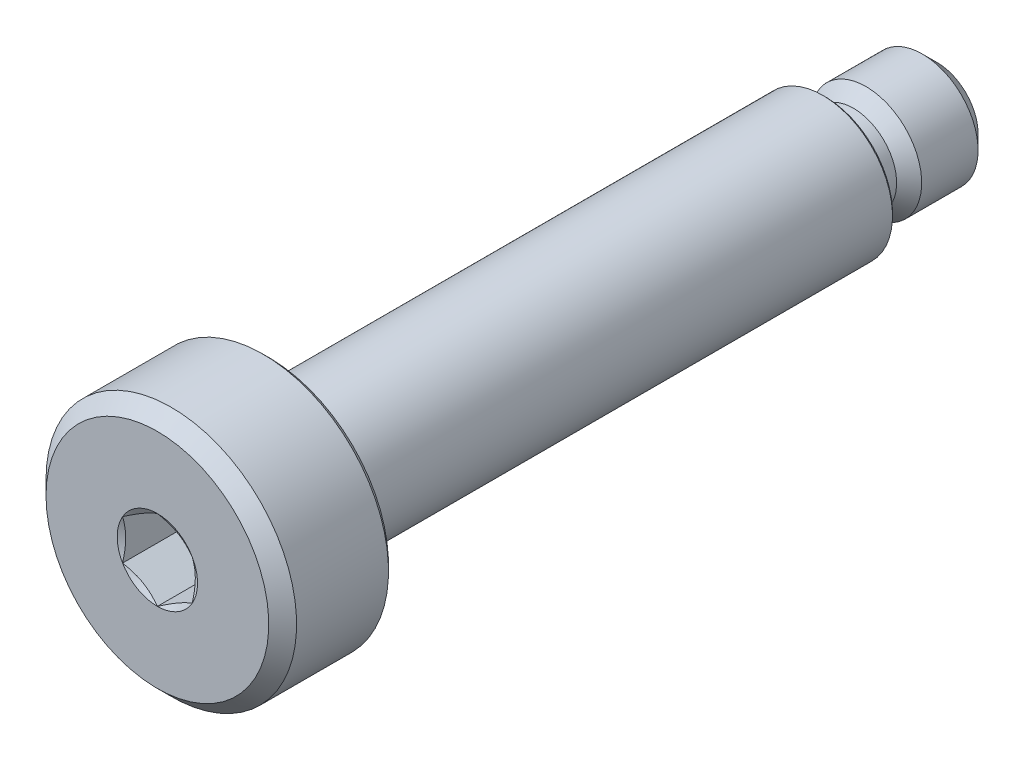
ISO-10303-21;
HEADER;
FILE_DESCRIPTION(('STEP AP214'),'2;1');
FILE_NAME('part.step','',(''),(''),'','','');
FILE_SCHEMA(('AUTOMOTIVE_DESIGN { 1 0 10303 214 1 1 1 1 }'));
ENDSEC;
DATA;
#1=APPLICATION_CONTEXT('core data for automotive mechanical design processes');
#2=APPLICATION_PROTOCOL_DEFINITION('international standard','automotive_design',2000,#1);
#3=PRODUCT_CONTEXT('',#1,'mechanical');
#4=PRODUCT('Part','Part','',(#3));
#5=PRODUCT_RELATED_PRODUCT_CATEGORY('part','',(#4));
#6=PRODUCT_DEFINITION_FORMATION('','',#4);
#7=PRODUCT_DEFINITION_CONTEXT('part definition',#1,'design');
#8=PRODUCT_DEFINITION('design','',#6,#7);
#9=PRODUCT_DEFINITION_SHAPE('','',#8);
#10=(LENGTH_UNIT() NAMED_UNIT(*) SI_UNIT(.MILLI.,.METRE.));
#11=(NAMED_UNIT(*) PLANE_ANGLE_UNIT() SI_UNIT($,.RADIAN.));
#12=(NAMED_UNIT(*) SI_UNIT($,.STERADIAN.) SOLID_ANGLE_UNIT());
#13=UNCERTAINTY_MEASURE_WITH_UNIT(LENGTH_MEASURE(1.E-05),#10,'distance_accuracy_value','');
#14=(GEOMETRIC_REPRESENTATION_CONTEXT(3) GLOBAL_UNCERTAINTY_ASSIGNED_CONTEXT((#13)) GLOBAL_UNIT_ASSIGNED_CONTEXT((#10,
#11,#12)) REPRESENTATION_CONTEXT('',''));
#15=CARTESIAN_POINT('',(0.,0.,0.));
#16=DIRECTION('',(0.,0.,1.));
#17=DIRECTION('',(1.,0.,0.));
#18=AXIS2_PLACEMENT_3D('',#15,#16,#17);
#19=CARTESIAN_POINT('',(0.,0.,14.));
#20=DIRECTION('',(0.,0.,1.));
#21=DIRECTION('',(1.,0.,0.));
#22=AXIS2_PLACEMENT_3D('',#19,#20,#21);
#23=PLANE('',#22);
#24=CARTESIAN_POINT('',(0.,0.,14.));
#25=DIRECTION('',(0.,0.,1.));
#26=DIRECTION('',(1.,0.,0.));
#27=AXIS2_PLACEMENT_3D('',#24,#25,#26);
#28=CIRCLE('',#27,1.44337567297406);
#29=CARTESIAN_POINT('',(1.25,0.721687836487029,14.));
#30=VERTEX_POINT('',#29);
#31=CARTESIAN_POINT('',(0.,1.44337567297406,14.));
#32=VERTEX_POINT('',#31);
#33=EDGE_CURVE('E142',#30,#32,#28,.T.);
#34=ORIENTED_EDGE('',*,*,#33,.F.);
#35=CARTESIAN_POINT('',(1.25,-0.721687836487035,14.));
#36=VERTEX_POINT('',#35);
#37=EDGE_CURVE('E139',#36,#30,#28,.T.);
#38=ORIENTED_EDGE('',*,*,#37,.F.);
#39=CARTESIAN_POINT('',(0.,-1.44337567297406,14.));
#40=VERTEX_POINT('',#39);
#41=EDGE_CURVE('E109',#40,#36,#28,.T.);
#42=ORIENTED_EDGE('',*,*,#41,.F.);
#43=CARTESIAN_POINT('',(-1.25,-0.721687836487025,14.));
#44=VERTEX_POINT('',#43);
#45=EDGE_CURVE('E100',#44,#40,#28,.T.);
#46=ORIENTED_EDGE('',*,*,#45,.F.);
#47=CARTESIAN_POINT('',(-1.25,0.721687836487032,14.));
#48=VERTEX_POINT('',#47);
#49=EDGE_CURVE('E61',#48,#44,#28,.T.);
#50=ORIENTED_EDGE('',*,*,#49,.F.);
#51=EDGE_CURVE('E68',#32,#48,#28,.T.);
#52=ORIENTED_EDGE('',*,*,#51,.F.);
#53=EDGE_LOOP('',(#34,#38,#42,#46,#50,#52));
#54=FACE_BOUND('',#53,.T.);
#55=CARTESIAN_POINT('',(0.,0.,14.));
#56=DIRECTION('',(0.,0.,-1.));
#57=DIRECTION('',(-1.,0.,0.));
#58=AXIS2_PLACEMENT_3D('',#55,#56,#57);
#59=CIRCLE('',#58,4.);
#60=CARTESIAN_POINT('',(-4.,0.,14.));
#61=VERTEX_POINT('',#60);
#62=EDGE_CURVE('E55',#61,#61,#59,.T.);
#63=ORIENTED_EDGE('',*,*,#62,.F.);
#64=EDGE_LOOP('',(#63));
#65=FACE_BOUND('',#64,.T.);
#66=ADVANCED_FACE('F41',(#54,#65),#23,.T.);
#67=CARTESIAN_POINT('',(0.,0.,13.5));
#68=DIRECTION('',(0.,0.,-1.));
#69=DIRECTION('',(-1.,0.,0.));
#70=AXIS2_PLACEMENT_3D('',#67,#68,#69);
#71=CONICAL_SURFACE('',#70,4.5,0.785398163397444);
#72=ORIENTED_EDGE('',*,*,#62,.T.);
#73=EDGE_LOOP('',(#72));
#74=FACE_BOUND('',#73,.T.);
#75=CARTESIAN_POINT('',(0.,0.,13.5));
#76=DIRECTION('',(0.,0.,-1.));
#77=DIRECTION('',(-1.,0.,0.));
#78=AXIS2_PLACEMENT_3D('',#75,#76,#77);
#79=CIRCLE('',#78,4.5);
#80=CARTESIAN_POINT('',(-4.5,0.,13.5));
#81=VERTEX_POINT('',#80);
#82=EDGE_CURVE('E365',#81,#81,#79,.T.);
#83=ORIENTED_EDGE('',*,*,#82,.F.);
#84=EDGE_LOOP('',(#83));
#85=FACE_BOUND('',#84,.T.);
#86=ADVANCED_FACE('F210',(#74,#85),#71,.T.);
#87=CARTESIAN_POINT('',(0.,0.,-14.));
#88=DIRECTION('',(0.,0.,-1.));
#89=DIRECTION('',(-1.,0.,0.));
#90=AXIS2_PLACEMENT_3D('',#87,#88,#89);
#91=CYLINDRICAL_SURFACE('',#90,4.5);
#92=ORIENTED_EDGE('',*,*,#82,.T.);
#93=EDGE_LOOP('',(#92));
#94=FACE_BOUND('',#93,.T.);
#95=CARTESIAN_POINT('',(0.,0.,10.2));
#96=DIRECTION('',(0.,0.,-1.));
#97=DIRECTION('',(-1.,0.,0.));
#98=AXIS2_PLACEMENT_3D('',#95,#96,#97);
#99=CIRCLE('',#98,4.5);
#100=CARTESIAN_POINT('',(-4.5,0.,10.2));
#101=VERTEX_POINT('',#100);
#102=EDGE_CURVE('E361',#101,#101,#99,.T.);
#103=ORIENTED_EDGE('',*,*,#102,.F.);
#104=EDGE_LOOP('',(#103));
#105=FACE_BOUND('',#104,.T.);
#106=ADVANCED_FACE('F216',(#94,#105),#91,.T.);
#107=CARTESIAN_POINT('',(0.,0.,10.));
#108=DIRECTION('',(0.,0.,1.));
#109=DIRECTION('',(1.,0.,0.));
#110=AXIS2_PLACEMENT_3D('',#107,#108,#109);
#111=CONICAL_SURFACE('',#110,4.3,0.78539816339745);
#112=ORIENTED_EDGE('',*,*,#102,.T.);
#113=EDGE_LOOP('',(#112));
#114=FACE_BOUND('',#113,.T.);
#115=CARTESIAN_POINT('',(0.,0.,10.));
#116=DIRECTION('',(0.,0.,-1.));
#117=DIRECTION('',(-1.,0.,0.));
#118=AXIS2_PLACEMENT_3D('',#115,#116,#117);
#119=CIRCLE('',#118,4.3);
#120=CARTESIAN_POINT('',(-4.3,0.,10.));
#121=VERTEX_POINT('',#120);
#122=EDGE_CURVE('E357',#121,#121,#119,.T.);
#123=ORIENTED_EDGE('',*,*,#122,.F.);
#124=EDGE_LOOP('',(#123));
#125=FACE_BOUND('',#124,.T.);
#126=ADVANCED_FACE('F221',(#114,#125),#111,.T.);
#127=CARTESIAN_POINT('',(0.,4.3,10.));
#128=DIRECTION('',(0.,0.,-1.));
#129=DIRECTION('',(-1.,0.,0.));
#130=AXIS2_PLACEMENT_3D('',#127,#128,#129);
#131=PLANE('',#130);
#132=ORIENTED_EDGE('',*,*,#122,.T.);
#133=EDGE_LOOP('',(#132));
#134=FACE_BOUND('',#133,.T.);
#135=CARTESIAN_POINT('',(0.,0.,10.));
#136=DIRECTION('',(0.,0.,-1.));
#137=DIRECTION('',(-1.,0.,0.));
#138=AXIS2_PLACEMENT_3D('',#135,#136,#137);
#139=CIRCLE('',#138,2.4);
#140=CARTESIAN_POINT('',(-2.4,0.,10.));
#141=VERTEX_POINT('',#140);
#142=EDGE_CURVE('E353',#141,#141,#139,.T.);
#143=ORIENTED_EDGE('',*,*,#142,.F.);
#144=EDGE_LOOP('',(#143));
#145=FACE_BOUND('',#144,.T.);
#146=ADVANCED_FACE('F229',(#134,#145),#131,.T.);
#147=CARTESIAN_POINT('',(0.,0.,-14.));
#148=DIRECTION('',(0.,0.,-1.));
#149=DIRECTION('',(-1.,0.,0.));
#150=AXIS2_PLACEMENT_3D('',#147,#148,#149);
#151=CYLINDRICAL_SURFACE('',#150,2.4);
#152=ORIENTED_EDGE('',*,*,#142,.T.);
#153=EDGE_LOOP('',(#152));
#154=FACE_BOUND('',#153,.T.);
#155=CARTESIAN_POINT('',(0.,0.,9.26));
#156=DIRECTION('',(0.,0.,-1.));
#157=DIRECTION('',(-1.,0.,0.));
#158=AXIS2_PLACEMENT_3D('',#155,#156,#157);
#159=CIRCLE('',#158,2.4);
#160=CARTESIAN_POINT('',(-2.4,0.,9.26));
#161=VERTEX_POINT('',#160);
#162=EDGE_CURVE('E349',#161,#161,#159,.T.);
#163=ORIENTED_EDGE('',*,*,#162,.F.);
#164=EDGE_LOOP('',(#163));
#165=FACE_BOUND('',#164,.T.);
#166=ADVANCED_FACE('F233',(#154,#165),#151,.T.);
#167=CARTESIAN_POINT('',(0.,0.,9.16));
#168=DIRECTION('',(0.,0.,-1.));
#169=DIRECTION('',(-1.,0.,0.));
#170=AXIS2_PLACEMENT_3D('',#167,#168,#169);
#171=CONICAL_SURFACE('',#170,2.5,0.785398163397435);
#172=ORIENTED_EDGE('',*,*,#162,.T.);
#173=EDGE_LOOP('',(#172));
#174=FACE_BOUND('',#173,.T.);
#175=CARTESIAN_POINT('',(0.,0.,9.16));
#176=DIRECTION('',(0.,0.,-1.));
#177=DIRECTION('',(-1.,0.,0.));
#178=AXIS2_PLACEMENT_3D('',#175,#176,#177);
#179=CIRCLE('',#178,2.5);
#180=CARTESIAN_POINT('',(-2.5,0.,9.16));
#181=VERTEX_POINT('',#180);
#182=EDGE_CURVE('E345',#181,#181,#179,.T.);
#183=ORIENTED_EDGE('',*,*,#182,.F.);
#184=EDGE_LOOP('',(#183));
#185=FACE_BOUND('',#184,.T.);
#186=ADVANCED_FACE('F237',(#174,#185),#171,.T.);
#187=CARTESIAN_POINT('',(0.,0.,-14.));
#188=DIRECTION('',(0.,0.,-1.));
#189=DIRECTION('',(-1.,0.,0.));
#190=AXIS2_PLACEMENT_3D('',#187,#188,#189);
#191=CYLINDRICAL_SURFACE('',#190,2.5);
#192=ORIENTED_EDGE('',*,*,#182,.T.);
#193=EDGE_LOOP('',(#192));
#194=FACE_BOUND('',#193,.T.);
#195=CARTESIAN_POINT('',(0.,0.,-9.9));
#196=DIRECTION('',(0.,0.,-1.));
#197=DIRECTION('',(-1.,0.,0.));
#198=AXIS2_PLACEMENT_3D('',#195,#196,#197);
#199=CIRCLE('',#198,2.5);
#200=CARTESIAN_POINT('',(-2.5,0.,-9.9));
#201=VERTEX_POINT('',#200);
#202=EDGE_CURVE('E341',#201,#201,#199,.T.);
#203=ORIENTED_EDGE('',*,*,#202,.F.);
#204=EDGE_LOOP('',(#203));
#205=FACE_BOUND('',#204,.T.);
#206=ADVANCED_FACE('F241',(#194,#205),#191,.T.);
#207=CARTESIAN_POINT('',(0.,0.,-10.));
#208=DIRECTION('',(0.,0.,1.));
#209=DIRECTION('',(1.,0.,0.));
#210=AXIS2_PLACEMENT_3D('',#207,#208,#209);
#211=CONICAL_SURFACE('',#210,2.4,0.785398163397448);
#212=ORIENTED_EDGE('',*,*,#202,.T.);
#213=EDGE_LOOP('',(#212));
#214=FACE_BOUND('',#213,.T.);
#215=CARTESIAN_POINT('',(0.,0.,-10.));
#216=DIRECTION('',(0.,0.,-1.));
#217=DIRECTION('',(-1.,0.,0.));
#218=AXIS2_PLACEMENT_3D('',#215,#216,#217);
#219=CIRCLE('',#218,2.4);
#220=CARTESIAN_POINT('',(-2.4,0.,-10.));
#221=VERTEX_POINT('',#220);
#222=EDGE_CURVE('E337',#221,#221,#219,.T.);
#223=ORIENTED_EDGE('',*,*,#222,.F.);
#224=EDGE_LOOP('',(#223));
#225=FACE_BOUND('',#224,.T.);
#226=ADVANCED_FACE('F245',(#214,#225),#211,.T.);
#227=CARTESIAN_POINT('',(0.,2.4,-10.));
#228=DIRECTION('',(0.,0.,-1.));
#229=DIRECTION('',(-1.,0.,0.));
#230=AXIS2_PLACEMENT_3D('',#227,#228,#229);
#231=PLANE('',#230);
#232=ORIENTED_EDGE('',*,*,#222,.T.);
#233=EDGE_LOOP('',(#232));
#234=FACE_BOUND('',#233,.T.);
#235=CARTESIAN_POINT('',(0.,0.,-10.));
#236=DIRECTION('',(0.,0.,-1.));
#237=DIRECTION('',(-1.,0.,0.));
#238=AXIS2_PLACEMENT_3D('',#235,#236,#237);
#239=CIRCLE('',#238,1.55);
#240=CARTESIAN_POINT('',(-1.55,0.,-10.));
#241=VERTEX_POINT('',#240);
#242=EDGE_CURVE('E333',#241,#241,#239,.T.);
#243=ORIENTED_EDGE('',*,*,#242,.F.);
#244=EDGE_LOOP('',(#243));
#245=FACE_BOUND('',#244,.T.);
#246=ADVANCED_FACE('F249',(#234,#245),#231,.T.);
#247=CARTESIAN_POINT('',(0.,0.,-14.));
#248=DIRECTION('',(0.,0.,-1.));
#249=DIRECTION('',(-1.,0.,0.));
#250=AXIS2_PLACEMENT_3D('',#247,#248,#249);
#251=CYLINDRICAL_SURFACE('',#250,1.55);
#252=ORIENTED_EDGE('',*,*,#242,.T.);
#253=EDGE_LOOP('',(#252));
#254=FACE_BOUND('',#253,.T.);
#255=CARTESIAN_POINT('',(0.,0.,-11.));
#256=DIRECTION('',(0.,0.,-1.));
#257=DIRECTION('',(-1.,0.,0.));
#258=AXIS2_PLACEMENT_3D('',#255,#256,#257);
#259=CIRCLE('',#258,1.55);
#260=CARTESIAN_POINT('',(-1.55,0.,-11.));
#261=VERTEX_POINT('',#260);
#262=EDGE_CURVE('E329',#261,#261,#259,.T.);
#263=ORIENTED_EDGE('',*,*,#262,.F.);
#264=EDGE_LOOP('',(#263));
#265=FACE_BOUND('',#264,.T.);
#266=ADVANCED_FACE('F253',(#254,#265),#251,.T.);
#267=CARTESIAN_POINT('',(0.,0.,-11.45));
#268=DIRECTION('',(0.,0.,-1.));
#269=DIRECTION('',(-1.,0.,0.));
#270=AXIS2_PLACEMENT_3D('',#267,#268,#269);
#271=CONICAL_SURFACE('',#270,2.,0.785398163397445);
#272=ORIENTED_EDGE('',*,*,#262,.T.);
#273=EDGE_LOOP('',(#272));
#274=FACE_BOUND('',#273,.T.);
#275=CARTESIAN_POINT('',(0.,0.,-11.45));
#276=DIRECTION('',(0.,0.,-1.));
#277=DIRECTION('',(-1.,0.,0.));
#278=AXIS2_PLACEMENT_3D('',#275,#276,#277);
#279=CIRCLE('',#278,2.);
#280=CARTESIAN_POINT('',(-2.,0.,-11.45));
#281=VERTEX_POINT('',#280);
#282=EDGE_CURVE('E325',#281,#281,#279,.T.);
#283=ORIENTED_EDGE('',*,*,#282,.F.);
#284=EDGE_LOOP('',(#283));
#285=FACE_BOUND('',#284,.T.);
#286=ADVANCED_FACE('F257',(#274,#285),#271,.T.);
#287=CARTESIAN_POINT('',(0.,0.,-14.));
#288=DIRECTION('',(0.,0.,-1.));
#289=DIRECTION('',(-1.,0.,0.));
#290=AXIS2_PLACEMENT_3D('',#287,#288,#289);
#291=CYLINDRICAL_SURFACE('',#290,2.);
#292=ORIENTED_EDGE('',*,*,#282,.T.);
#293=EDGE_LOOP('',(#292));
#294=FACE_BOUND('',#293,.T.);
#295=CARTESIAN_POINT('',(0.,0.,-13.475));
#296=DIRECTION('',(0.,0.,-1.));
#297=DIRECTION('',(-1.,0.,0.));
#298=AXIS2_PLACEMENT_3D('',#295,#296,#297);
#299=CIRCLE('',#298,2.);
#300=CARTESIAN_POINT('',(-2.,0.,-13.475));
#301=VERTEX_POINT('',#300);
#302=EDGE_CURVE('E321',#301,#301,#299,.T.);
#303=ORIENTED_EDGE('',*,*,#302,.F.);
#304=EDGE_LOOP('',(#303));
#305=FACE_BOUND('',#304,.T.);
#306=ADVANCED_FACE('F261',(#294,#305),#291,.T.);
#307=CARTESIAN_POINT('',(0.,0.,-14.));
#308=DIRECTION('',(0.,0.,1.));
#309=DIRECTION('',(1.,0.,0.));
#310=AXIS2_PLACEMENT_3D('',#307,#308,#309);
#311=CONICAL_SURFACE('',#310,1.475,0.785398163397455);
#312=ORIENTED_EDGE('',*,*,#302,.T.);
#313=EDGE_LOOP('',(#312));
#314=FACE_BOUND('',#313,.T.);
#315=CARTESIAN_POINT('',(0.,0.,-14.));
#316=DIRECTION('',(0.,0.,-1.));
#317=DIRECTION('',(-1.,0.,0.));
#318=AXIS2_PLACEMENT_3D('',#315,#316,#317);
#319=CIRCLE('',#318,1.475);
#320=CARTESIAN_POINT('',(-1.475,0.,-14.));
#321=VERTEX_POINT('',#320);
#322=EDGE_CURVE('E304',#321,#321,#319,.T.);
#323=ORIENTED_EDGE('',*,*,#322,.F.);
#324=EDGE_LOOP('',(#323));
#325=FACE_BOUND('',#324,.T.);
#326=ADVANCED_FACE('F265',(#314,#325),#311,.T.);
#327=CARTESIAN_POINT('',(0.,1.475,-14.));
#328=DIRECTION('',(0.,0.,-1.));
#329=DIRECTION('',(-1.,0.,0.));
#330=AXIS2_PLACEMENT_3D('',#327,#328,#329);
#331=PLANE('',#330);
#332=ORIENTED_EDGE('',*,*,#322,.T.);
#333=EDGE_LOOP('',(#332));
#334=FACE_BOUND('',#333,.T.);
#335=ADVANCED_FACE('F269',(#334),#331,.T.);
#336=CARTESIAN_POINT('',(0.,0.,14.));
#337=DIRECTION('',(0.,0.,1.));
#338=DIRECTION('',(1.,0.,0.));
#339=AXIS2_PLACEMENT_3D('',#336,#337,#338);
#340=CONICAL_SURFACE('',#339,1.44337567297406,1.0471975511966);
#341=ORIENTED_EDGE('',*,*,#41,.T.);
#342=CARTESIAN_POINT('',(-0.000200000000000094,-1.4434911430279,14.000066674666));
#343=CARTESIAN_POINT('',(0.0547333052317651,-1.41177538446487,13.9817459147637));
#344=CARTESIAN_POINT('',(0.11014078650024,-1.3797858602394,13.9650833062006));
#345=CARTESIAN_POINT('',(0.22191536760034,-1.3152527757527,13.9359973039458));
#346=CARTESIAN_POINT('',(0.278284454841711,-1.28270806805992,13.9235842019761));
#347=CARTESIAN_POINT('',(0.390323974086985,-1.21802202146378,13.904259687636));
#348=CARTESIAN_POINT('',(0.44597715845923,-1.18589064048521,13.8972196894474));
#349=CARTESIAN_POINT('',(0.557545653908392,-1.12147653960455,13.8888124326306));
#350=CARTESIAN_POINT('',(0.613460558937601,-1.08919405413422,13.8874382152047));
#351=CARTESIAN_POINT('',(0.717957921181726,-1.02886247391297,13.8902833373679));
#352=CARTESIAN_POINT('',(0.766555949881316,-1.00080438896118,13.89380409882));
#353=CARTESIAN_POINT('',(0.863435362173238,-0.944871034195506,13.9049671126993));
#354=CARTESIAN_POINT('',(0.911716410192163,-0.916995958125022,13.9126131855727));
#355=CARTESIAN_POINT('',(1.00879588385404,-0.860947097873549,13.9317294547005));
#356=CARTESIAN_POINT('',(1.0575820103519,-0.832780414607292,13.9432807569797));
#357=CARTESIAN_POINT('',(1.1544262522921,-0.776867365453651,13.9694983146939));
#358=CARTESIAN_POINT('',(1.20248561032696,-0.749120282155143,13.9841584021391));
#359=CARTESIAN_POINT('',(1.2502,-0.721572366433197,14.000066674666));
#360=B_SPLINE_CURVE_WITH_KNOTS('',3,(#342,#343,#344,#345,#346,#347,#348,#349,#350,#351,#352,
#353,#354,#355,#356,#357,#358,#359),.UNSPECIFIED.,.F.,.F.,(4,2,2,2,2,2,2,2,4),(0.,
0.19815082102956,0.396778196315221,0.5904886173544,0.783961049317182,0.952480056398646,
1.1211553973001,1.2935743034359,1.4656542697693),.UNSPECIFIED.);
#361=EDGE_CURVE('E11',#40,#36,#360,.T.);
#362=ORIENTED_EDGE('',*,*,#361,.F.);
#363=EDGE_LOOP('',(#341,#362));
#364=FACE_BOUND('',#363,.T.);
#365=ADVANCED_FACE('F113',(#364),#340,.F.);
#366=ORIENTED_EDGE('',*,*,#37,.T.);
#367=CARTESIAN_POINT('',(1.25,-1.86893140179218,14.4647941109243));
#368=CARTESIAN_POINT('',(1.25,-1.81495202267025,14.4388968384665));
#369=CARTESIAN_POINT('',(1.25,-1.76084125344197,14.4132686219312));
#370=CARTESIAN_POINT('',(1.25,-1.65228662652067,14.3627027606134));
#371=CARTESIAN_POINT('',(1.25,-1.59784271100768,14.3377652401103));
#372=CARTESIAN_POINT('',(1.25,-1.48823931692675,14.2885939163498));
#373=CARTESIAN_POINT('',(1.25,-1.43307750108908,14.2643652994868));
#374=CARTESIAN_POINT('',(1.25,-1.32229188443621,14.2169950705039));
#375=CARTESIAN_POINT('',(1.25,-1.26666810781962,14.1938534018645));
#376=CARTESIAN_POINT('',(1.25,-1.15340083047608,14.1483546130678));
#377=CARTESIAN_POINT('',(1.25,-1.09574254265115,14.1260338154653));
#378=CARTESIAN_POINT('',(1.25,-0.979741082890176,14.083255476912));
#379=CARTESIAN_POINT('',(1.25,-0.921397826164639,14.0627981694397));
#380=CARTESIAN_POINT('',(1.25,-0.745435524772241,14.0050842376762));
#381=CARTESIAN_POINT('',(1.25,-0.62656193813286,13.9713502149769));
#382=CARTESIAN_POINT('',(1.25,-0.445873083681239,13.9322204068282));
#383=CARTESIAN_POINT('',(1.25,-0.385304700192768,13.9210940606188));
#384=CARTESIAN_POINT('',(1.25,-0.26348659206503,13.9034278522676));
#385=CARTESIAN_POINT('',(1.25,-0.202236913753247,13.8968876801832));
#386=CARTESIAN_POINT('',(1.25,-0.0801324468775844,13.8889987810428));
#387=CARTESIAN_POINT('',(1.25,-0.019281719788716,13.8875887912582));
#388=CARTESIAN_POINT('',(1.25,0.102319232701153,13.8899161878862));
#389=CARTESIAN_POINT('',(1.25,0.16306945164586,13.893653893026));
#390=CARTESIAN_POINT('',(1.25,0.312961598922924,13.9088980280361));
#391=CARTESIAN_POINT('',(1.25,0.401813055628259,13.9232612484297));
#392=CARTESIAN_POINT('',(1.25,0.577788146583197,13.9602998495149));
#393=CARTESIAN_POINT('',(1.25,0.664909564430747,13.9829852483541));
#394=CARTESIAN_POINT('',(1.25,0.79520922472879,14.0217374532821));
#395=CARTESIAN_POINT('',(1.25,0.839061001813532,14.0356229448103));
#396=CARTESIAN_POINT('',(1.25,0.926308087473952,14.0646784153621));
#397=CARTESIAN_POINT('',(1.25,0.969703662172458,14.0798475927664));
#398=CARTESIAN_POINT('',(1.25,1.05609633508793,14.1112501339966));
#399=CARTESIAN_POINT('',(1.25,1.09909350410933,14.127483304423));
#400=CARTESIAN_POINT('',(1.25,1.18474903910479,14.1608382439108));
#401=CARTESIAN_POINT('',(1.25,1.22740734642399,14.1779601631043));
#402=CARTESIAN_POINT('',(1.25,1.33629459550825,14.2227614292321));
#403=CARTESIAN_POINT('',(1.25,1.40230581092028,14.2509693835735));
#404=CARTESIAN_POINT('',(1.25,1.53373213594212,14.3087450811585));
#405=CARTESIAN_POINT('',(1.25,1.59914720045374,14.3383129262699));
#406=CARTESIAN_POINT('',(1.25,1.79469680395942,14.4285769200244));
#407=CARTESIAN_POINT('',(1.25,1.92411390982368,14.4908242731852));
#408=CARTESIAN_POINT('',(1.25,2.18184246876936,14.6179296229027));
#409=CARTESIAN_POINT('',(1.25,2.31015236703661,14.682790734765));
#410=CARTESIAN_POINT('',(1.25,2.56589305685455,14.8141807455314));
#411=CARTESIAN_POINT('',(1.25,2.69332395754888,14.8807094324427));
#412=CARTESIAN_POINT('',(1.25,2.93557826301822,15.0085820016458));
#413=CARTESIAN_POINT('',(1.25,3.05045639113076,15.0698225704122));
#414=CARTESIAN_POINT('',(1.25,3.27984311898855,15.1930014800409));
#415=CARTESIAN_POINT('',(1.25,3.39435170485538,15.2549398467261));
#416=CARTESIAN_POINT('',(1.25,3.62279327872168,15.3791811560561));
#417=CARTESIAN_POINT('',(1.25,3.73672698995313,15.441482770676));
#418=CARTESIAN_POINT('',(1.25,3.96436406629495,15.5664914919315));
#419=CARTESIAN_POINT('',(1.25,4.07806744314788,15.6291985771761));
#420=CARTESIAN_POINT('',(1.25,4.19168806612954,15.6920543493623));
#421=B_SPLINE_CURVE_WITH_KNOTS('',3,(#367,#368,#369,#370,#371,#372,#373,#374,#375,#376,#377,
#378,#379,#380,#381,#382,#383,#384,#385,#386,#387,#388,#389,#390,#391,#392,#393,#394,#395,#396,
#397,#398,#399,#400,#401,#402,#403,#404,#405,#406,#407,#408,#409,#410,#411,#412,#413,#414,#415,
#416,#417,#418,#419,#420),.UNSPECIFIED.,.F.,.F.,(4,2,2,2,2,2,2,2,2,2,2,2,2,2,2,2,2,2,2,2,2,2,2,
2,2,2,4),(0.,0.179612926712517,0.359257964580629,0.539992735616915,0.72071809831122,
0.906167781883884,1.09164066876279,1.46154014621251,1.64614554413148,1.83073846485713,
2.01311967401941,2.19551217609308,2.46497297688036,2.73475922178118,2.8727370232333,
3.01062928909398,3.14849655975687,3.2863871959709,3.50172172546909,3.71707241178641,
4.14784491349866,4.57914698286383,5.0103944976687,5.40093821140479,5.7914964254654,
6.18106124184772,6.57060567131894),.UNSPECIFIED.);
#422=EDGE_CURVE('E145',#36,#30,#421,.T.);
#423=ORIENTED_EDGE('',*,*,#422,.F.);
#424=EDGE_LOOP('',(#366,#423));
#425=FACE_BOUND('',#424,.T.);
#426=ADVANCED_FACE('F413',(#425),#340,.F.);
#427=ORIENTED_EDGE('',*,*,#33,.T.);
#428=CARTESIAN_POINT('',(1.2502,0.721572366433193,14.000066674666));
#429=CARTESIAN_POINT('',(1.19526669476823,0.753288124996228,13.9817459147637));
#430=CARTESIAN_POINT('',(1.13985921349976,0.785277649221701,13.9650833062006));
#431=CARTESIAN_POINT('',(1.02808463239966,0.849810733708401,13.9359973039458));
#432=CARTESIAN_POINT('',(0.97171554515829,0.88235544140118,13.9235842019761));
#433=CARTESIAN_POINT('',(0.859676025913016,0.947041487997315,13.904259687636));
#434=CARTESIAN_POINT('',(0.804022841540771,0.979172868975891,13.8972196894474));
#435=CARTESIAN_POINT('',(0.692454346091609,1.04358696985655,13.8888124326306));
#436=CARTESIAN_POINT('',(0.6365394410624,1.07586945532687,13.8874382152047));
#437=CARTESIAN_POINT('',(0.532042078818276,1.13620103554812,13.8902833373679));
#438=CARTESIAN_POINT('',(0.483444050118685,1.16425912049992,13.89380409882));
#439=CARTESIAN_POINT('',(0.386564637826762,1.22019247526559,13.9049671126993));
#440=CARTESIAN_POINT('',(0.338283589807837,1.24806755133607,13.9126131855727));
#441=CARTESIAN_POINT('',(0.241204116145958,1.30411641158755,13.9317294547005));
#442=CARTESIAN_POINT('',(0.192417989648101,1.3322830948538,13.9432807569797));
#443=CARTESIAN_POINT('',(0.0955737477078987,1.38819614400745,13.9694983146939));
#444=CARTESIAN_POINT('',(0.0475143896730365,1.41594322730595,13.9841584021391));
#445=CARTESIAN_POINT('',(-0.000199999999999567,1.4434911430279,14.000066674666));
#446=B_SPLINE_CURVE_WITH_KNOTS('',3,(#428,#429,#430,#431,#432,#433,#434,#435,#436,#437,#438,
#439,#440,#441,#442,#443,#444,#445),.UNSPECIFIED.,.F.,.F.,(4,2,2,2,2,2,2,2,4),(0.,
0.198150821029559,0.39677819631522,0.590488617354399,0.783961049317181,0.952480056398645,
1.1211553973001,1.2935743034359,1.4656542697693),.UNSPECIFIED.);
#447=EDGE_CURVE('E154',#30,#32,#446,.T.);
#448=ORIENTED_EDGE('',*,*,#447,.F.);
#449=EDGE_LOOP('',(#427,#448));
#450=FACE_BOUND('',#449,.T.);
#451=ADVANCED_FACE('F406',(#450),#340,.F.);
#452=ORIENTED_EDGE('',*,*,#51,.T.);
#453=CARTESIAN_POINT('',(0.000200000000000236,1.4434911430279,14.000066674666));
#454=CARTESIAN_POINT('',(-0.0547333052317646,1.41177538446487,13.9817459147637));
#455=CARTESIAN_POINT('',(-0.110140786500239,1.37978586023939,13.9650833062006));
#456=CARTESIAN_POINT('',(-0.221915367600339,1.31525277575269,13.9359973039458));
#457=CARTESIAN_POINT('',(-0.278284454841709,1.28270806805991,13.9235842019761));
#458=CARTESIAN_POINT('',(-0.390323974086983,1.21802202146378,13.904259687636));
#459=CARTESIAN_POINT('',(-0.445977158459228,1.1858906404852,13.8972196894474));
#460=CARTESIAN_POINT('',(-0.55754565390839,1.12147653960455,13.8888124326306));
#461=CARTESIAN_POINT('',(-0.613460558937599,1.08919405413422,13.8874382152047));
#462=CARTESIAN_POINT('',(-0.717957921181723,1.02886247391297,13.8902833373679));
#463=CARTESIAN_POINT('',(-0.766555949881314,1.00080438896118,13.89380409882));
#464=CARTESIAN_POINT('',(-0.863435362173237,0.944871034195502,13.9049671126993));
#465=CARTESIAN_POINT('',(-0.911716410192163,0.916995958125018,13.9126131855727));
#466=CARTESIAN_POINT('',(-1.00879588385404,0.860947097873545,13.9317294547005));
#467=CARTESIAN_POINT('',(-1.0575820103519,0.832780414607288,13.9432807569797));
#468=CARTESIAN_POINT('',(-1.1544262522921,0.776867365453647,13.9694983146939));
#469=CARTESIAN_POINT('',(-1.20248561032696,0.749120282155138,13.9841584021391));
#470=CARTESIAN_POINT('',(-1.2502,0.721572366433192,14.000066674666));
#471=B_SPLINE_CURVE_WITH_KNOTS('',3,(#453,#454,#455,#456,#457,#458,#459,#460,#461,#462,#463,
#464,#465,#466,#467,#468,#469,#470),.UNSPECIFIED.,.F.,.F.,(4,2,2,2,2,2,2,2,4),(0.,
0.198150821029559,0.39677819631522,0.590488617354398,0.78396104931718,0.952480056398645,
1.1211553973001,1.2935743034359,1.4656542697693),.UNSPECIFIED.);
#472=EDGE_CURVE('E174',#32,#48,#471,.T.);
#473=ORIENTED_EDGE('',*,*,#472,.F.);
#474=EDGE_LOOP('',(#452,#473));
#475=FACE_BOUND('',#474,.T.);
#476=ADVANCED_FACE('F407',(#475),#340,.F.);
#477=ORIENTED_EDGE('',*,*,#49,.T.);
#478=CARTESIAN_POINT('',(-1.25,-1.86893140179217,14.4647941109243));
#479=CARTESIAN_POINT('',(-1.25,-1.81495202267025,14.4388968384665));
#480=CARTESIAN_POINT('',(-1.25,-1.76084125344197,14.4132686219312));
#481=CARTESIAN_POINT('',(-1.25,-1.65228662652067,14.3627027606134));
#482=CARTESIAN_POINT('',(-1.25,-1.59784271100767,14.3377652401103));
#483=CARTESIAN_POINT('',(-1.25,-1.48823931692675,14.2885939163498));
#484=CARTESIAN_POINT('',(-1.25,-1.43307750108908,14.2643652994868));
#485=CARTESIAN_POINT('',(-1.25,-1.32229188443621,14.2169950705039));
#486=CARTESIAN_POINT('',(-1.25,-1.26666810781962,14.1938534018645));
#487=CARTESIAN_POINT('',(-1.25,-1.15340083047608,14.1483546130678));
#488=CARTESIAN_POINT('',(-1.25,-1.09574254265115,14.1260338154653));
#489=CARTESIAN_POINT('',(-1.25,-0.979741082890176,14.083255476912));
#490=CARTESIAN_POINT('',(-1.25,-0.921397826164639,14.0627981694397));
#491=CARTESIAN_POINT('',(-1.25,-0.745435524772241,14.0050842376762));
#492=CARTESIAN_POINT('',(-1.25,-0.626561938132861,13.9713502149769));
#493=CARTESIAN_POINT('',(-1.25,-0.445873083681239,13.9322204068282));
#494=CARTESIAN_POINT('',(-1.25,-0.385304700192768,13.9210940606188));
#495=CARTESIAN_POINT('',(-1.25,-0.26348659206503,13.9034278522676));
#496=CARTESIAN_POINT('',(-1.25,-0.202236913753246,13.8968876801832));
#497=CARTESIAN_POINT('',(-1.25,-0.0801324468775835,13.8889987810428));
#498=CARTESIAN_POINT('',(-1.25,-0.019281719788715,13.8875887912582));
#499=CARTESIAN_POINT('',(-1.25,0.102319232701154,13.8899161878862));
#500=CARTESIAN_POINT('',(-1.25,0.163069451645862,13.893653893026));
#501=CARTESIAN_POINT('',(-1.25,0.312961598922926,13.9088980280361));
#502=CARTESIAN_POINT('',(-1.25,0.401813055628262,13.9232612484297));
#503=CARTESIAN_POINT('',(-1.25,0.5777881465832,13.9602998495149));
#504=CARTESIAN_POINT('',(-1.25,0.66490956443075,13.9829852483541));
#505=CARTESIAN_POINT('',(-1.25,0.795209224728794,14.0217374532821));
#506=CARTESIAN_POINT('',(-1.25,0.839061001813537,14.0356229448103));
#507=CARTESIAN_POINT('',(-1.25,0.926308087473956,14.0646784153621));
#508=CARTESIAN_POINT('',(-1.25,0.969703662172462,14.0798475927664));
#509=CARTESIAN_POINT('',(-1.25,1.05609633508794,14.1112501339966));
#510=CARTESIAN_POINT('',(-1.25,1.09909350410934,14.127483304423));
#511=CARTESIAN_POINT('',(-1.25,1.1847490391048,14.1608382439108));
#512=CARTESIAN_POINT('',(-1.25,1.22740734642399,14.1779601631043));
#513=CARTESIAN_POINT('',(-1.25,1.33629459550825,14.2227614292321));
#514=CARTESIAN_POINT('',(-1.25,1.40230581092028,14.2509693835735));
#515=CARTESIAN_POINT('',(-1.25,1.53373213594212,14.3087450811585));
#516=CARTESIAN_POINT('',(-1.25,1.59914720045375,14.3383129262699));
#517=CARTESIAN_POINT('',(-1.25,1.79469680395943,14.4285769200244));
#518=CARTESIAN_POINT('',(-1.25,1.92411390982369,14.4908242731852));
#519=CARTESIAN_POINT('',(-1.25,2.18184246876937,14.6179296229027));
#520=CARTESIAN_POINT('',(-1.25,2.31015236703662,14.682790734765));
#521=CARTESIAN_POINT('',(-1.25,2.56589305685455,14.8141807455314));
#522=CARTESIAN_POINT('',(-1.25,2.69332395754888,14.8807094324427));
#523=CARTESIAN_POINT('',(-1.25,2.93557826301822,15.0085820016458));
#524=CARTESIAN_POINT('',(-1.25,3.05045639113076,15.0698225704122));
#525=CARTESIAN_POINT('',(-1.25,3.27984311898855,15.1930014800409));
#526=CARTESIAN_POINT('',(-1.25,3.39435170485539,15.2549398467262));
#527=CARTESIAN_POINT('',(-1.25,3.62279327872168,15.3791811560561));
#528=CARTESIAN_POINT('',(-1.25,3.73672698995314,15.441482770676));
#529=CARTESIAN_POINT('',(-1.25,3.96436406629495,15.5664914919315));
#530=CARTESIAN_POINT('',(-1.25,4.07806744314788,15.6291985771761));
#531=CARTESIAN_POINT('',(-1.25,4.19168806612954,15.6920543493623));
#532=B_SPLINE_CURVE_WITH_KNOTS('',3,(#478,#479,#480,#481,#482,#483,#484,#485,#486,#487,#488,
#489,#490,#491,#492,#493,#494,#495,#496,#497,#498,#499,#500,#501,#502,#503,#504,#505,#506,#507,
#508,#509,#510,#511,#512,#513,#514,#515,#516,#517,#518,#519,#520,#521,#522,#523,#524,#525,#526,
#527,#528,#529,#530,#531),.UNSPECIFIED.,.F.,.F.,(4,2,2,2,2,2,2,2,2,2,2,2,2,2,2,2,2,2,2,2,2,2,2,
2,2,2,4),(0.,0.179612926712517,0.359257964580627,0.539992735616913,0.720718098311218,
0.906167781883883,1.09164066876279,1.46154014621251,1.64614554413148,1.83073846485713,
2.01311967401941,2.19551217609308,2.46497297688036,2.73475922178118,2.8727370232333,
3.01062928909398,3.14849655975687,3.2863871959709,3.5017217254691,3.71707241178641,
4.14784491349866,4.57914698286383,5.01039449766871,5.40093821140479,5.7914964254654,
6.18106124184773,6.57060567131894),.UNSPECIFIED.);
#533=EDGE_CURVE('E126',#48,#44,#532,.F.);
#534=ORIENTED_EDGE('',*,*,#533,.F.);
#535=EDGE_LOOP('',(#477,#534));
#536=FACE_BOUND('',#535,.T.);
#537=ADVANCED_FACE('F167',(#536),#340,.F.);
#538=ORIENTED_EDGE('',*,*,#45,.T.);
#539=CARTESIAN_POINT('',(-1.2502,-0.721572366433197,14.000066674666));
#540=CARTESIAN_POINT('',(-1.19526669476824,-0.753288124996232,13.9817459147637));
#541=CARTESIAN_POINT('',(-1.13985921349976,-0.785277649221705,13.9650833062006));
#542=CARTESIAN_POINT('',(-1.02808463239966,-0.849810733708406,13.9359973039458));
#543=CARTESIAN_POINT('',(-0.97171554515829,-0.882355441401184,13.9235842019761));
#544=CARTESIAN_POINT('',(-0.859676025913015,-0.94704148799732,13.904259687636));
#545=CARTESIAN_POINT('',(-0.80402284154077,-0.979172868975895,13.8972196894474));
#546=CARTESIAN_POINT('',(-0.692454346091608,-1.04358696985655,13.8888124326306));
#547=CARTESIAN_POINT('',(-0.636539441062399,-1.07586945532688,13.8874382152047));
#548=CARTESIAN_POINT('',(-0.532042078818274,-1.13620103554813,13.8902833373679));
#549=CARTESIAN_POINT('',(-0.483444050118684,-1.16425912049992,13.89380409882));
#550=CARTESIAN_POINT('',(-0.386564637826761,-1.2201924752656,13.9049671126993));
#551=CARTESIAN_POINT('',(-0.338283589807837,-1.24806755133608,13.9126131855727));
#552=CARTESIAN_POINT('',(-0.241204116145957,-1.30411641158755,13.9317294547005));
#553=CARTESIAN_POINT('',(-0.192417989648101,-1.33228309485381,13.9432807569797));
#554=CARTESIAN_POINT('',(-0.0955737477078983,-1.38819614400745,13.9694983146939));
#555=CARTESIAN_POINT('',(-0.0475143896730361,-1.41594322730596,13.9841584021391));
#556=CARTESIAN_POINT('',(0.000199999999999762,-1.4434911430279,14.000066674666));
#557=B_SPLINE_CURVE_WITH_KNOTS('',3,(#539,#540,#541,#542,#543,#544,#545,#546,#547,#548,#549,
#550,#551,#552,#553,#554,#555,#556),.UNSPECIFIED.,.F.,.F.,(4,2,2,2,2,2,2,2,4),(0.,
0.198150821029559,0.396778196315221,0.5904886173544,0.783961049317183,0.952480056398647,
1.1211553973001,1.2935743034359,1.4656542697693),.UNSPECIFIED.);
#558=EDGE_CURVE('E104',#44,#40,#557,.T.);
#559=ORIENTED_EDGE('',*,*,#558,.F.);
#560=EDGE_LOOP('',(#538,#559));
#561=FACE_BOUND('',#560,.T.);
#562=ADVANCED_FACE('F102',(#561),#340,.F.);
#563=CARTESIAN_POINT('',(0.,0.,12.));
#564=DIRECTION('',(0.,0.,1.));
#565=DIRECTION('',(1.,0.,0.));
#566=AXIS2_PLACEMENT_3D('',#563,#564,#565);
#567=PLANE('',#566);
#568=DIRECTION('',(0.866025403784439,-0.5,0.));
#569=VECTOR('',#568,1.);
#570=CARTESIAN_POINT('',(-1.25,-0.721687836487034,12.));
#571=LINE('',#570,#569);
#572=CARTESIAN_POINT('',(-1.25,-0.721687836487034,12.));
#573=VERTEX_POINT('',#572);
#574=CARTESIAN_POINT('',(0.,-1.44337567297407,12.));
#575=VERTEX_POINT('',#574);
#576=EDGE_CURVE('E125',#573,#575,#571,.T.);
#577=ORIENTED_EDGE('',*,*,#576,.T.);
#578=DIRECTION('',(0.866025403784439,0.5,0.));
#579=VECTOR('',#578,1.);
#580=CARTESIAN_POINT('',(0.,-1.44337567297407,12.));
#581=LINE('',#580,#579);
#582=CARTESIAN_POINT('',(1.25,-0.721687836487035,12.));
#583=VERTEX_POINT('',#582);
#584=EDGE_CURVE('E130',#575,#583,#581,.T.);
#585=ORIENTED_EDGE('',*,*,#584,.T.);
#586=DIRECTION('',(0.,1.,0.));
#587=VECTOR('',#586,1.);
#588=CARTESIAN_POINT('',(1.25,-0.721687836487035,12.));
#589=LINE('',#588,#587);
#590=CARTESIAN_POINT('',(1.25,0.721687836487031,12.));
#591=VERTEX_POINT('',#590);
#592=EDGE_CURVE('E288',#583,#591,#589,.T.);
#593=ORIENTED_EDGE('',*,*,#592,.T.);
#594=DIRECTION('',(-0.866025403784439,0.5,0.));
#595=VECTOR('',#594,1.);
#596=CARTESIAN_POINT('',(1.25,0.721687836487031,12.));
#597=LINE('',#596,#595);
#598=CARTESIAN_POINT('',(0.,1.44337567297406,12.));
#599=VERTEX_POINT('',#598);
#600=EDGE_CURVE('E293',#591,#599,#597,.T.);
#601=ORIENTED_EDGE('',*,*,#600,.T.);
#602=DIRECTION('',(-0.866025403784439,-0.5,0.));
#603=VECTOR('',#602,1.);
#604=CARTESIAN_POINT('',(0.,1.44337567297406,12.));
#605=LINE('',#604,#603);
#606=CARTESIAN_POINT('',(-1.25,0.72168783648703,12.));
#607=VERTEX_POINT('',#606);
#608=EDGE_CURVE('E297',#599,#607,#605,.T.);
#609=ORIENTED_EDGE('',*,*,#608,.T.);
#610=DIRECTION('',(0.,-1.,0.));
#611=VECTOR('',#610,1.);
#612=CARTESIAN_POINT('',(-1.25,0.72168783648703,12.));
#613=LINE('',#612,#611);
#614=EDGE_CURVE('E134',#607,#573,#613,.T.);
#615=ORIENTED_EDGE('',*,*,#614,.T.);
#616=EDGE_LOOP('',(#577,#585,#593,#601,#609,#615));
#617=FACE_BOUND('',#616,.T.);
#618=ADVANCED_FACE('F166',(#617),#567,.T.);
#619=CARTESIAN_POINT('',(0.,-1.44337567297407,12.));
#620=DIRECTION('',(0.5,-0.866025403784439,0.));
#621=DIRECTION('',(0.866025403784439,0.5,0.));
#622=AXIS2_PLACEMENT_3D('',#619,#620,#621);
#623=PLANE('',#622);
#624=DIRECTION('',(0.,0.,1.));
#625=VECTOR('',#624,1.);
#626=CARTESIAN_POINT('',(0.,-1.44337567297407,12.));
#627=LINE('',#626,#625);
#628=EDGE_CURVE('E121',#575,#40,#627,.T.);
#629=ORIENTED_EDGE('',*,*,#628,.T.);
#630=ORIENTED_EDGE('',*,*,#361,.T.);
#631=DIRECTION('',(0.,0.,1.));
#632=VECTOR('',#631,1.);
#633=CARTESIAN_POINT('',(1.25,-0.721687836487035,12.));
#634=LINE('',#633,#632);
#635=EDGE_CURVE('E133',#583,#36,#634,.T.);
#636=ORIENTED_EDGE('',*,*,#635,.F.);
#637=ORIENTED_EDGE('',*,*,#584,.F.);
#638=EDGE_LOOP('',(#629,#630,#636,#637));
#639=FACE_BOUND('',#638,.T.);
#640=ADVANCED_FACE('F128',(#639),#623,.F.);
#641=CARTESIAN_POINT('',(1.25,-0.721687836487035,12.));
#642=DIRECTION('',(1.,0.,0.));
#643=DIRECTION('',(0.,1.,0.));
#644=AXIS2_PLACEMENT_3D('',#641,#642,#643);
#645=PLANE('',#644);
#646=ORIENTED_EDGE('',*,*,#635,.T.);
#647=ORIENTED_EDGE('',*,*,#422,.T.);
#648=DIRECTION('',(0.,0.,1.));
#649=VECTOR('',#648,1.);
#650=CARTESIAN_POINT('',(1.25,0.721687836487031,12.));
#651=LINE('',#650,#649);
#652=EDGE_CURVE('E313',#591,#30,#651,.T.);
#653=ORIENTED_EDGE('',*,*,#652,.F.);
#654=ORIENTED_EDGE('',*,*,#592,.F.);
#655=EDGE_LOOP('',(#646,#647,#653,#654));
#656=FACE_BOUND('',#655,.T.);
#657=ADVANCED_FACE('F161',(#656),#645,.F.);
#658=CARTESIAN_POINT('',(1.25,0.721687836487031,12.));
#659=DIRECTION('',(0.5,0.866025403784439,0.));
#660=DIRECTION('',(-0.866025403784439,0.5,0.));
#661=AXIS2_PLACEMENT_3D('',#658,#659,#660);
#662=PLANE('',#661);
#663=ORIENTED_EDGE('',*,*,#652,.T.);
#664=ORIENTED_EDGE('',*,*,#447,.T.);
#665=DIRECTION('',(0.,0.,1.));
#666=VECTOR('',#665,1.);
#667=CARTESIAN_POINT('',(0.,1.44337567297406,12.));
#668=LINE('',#667,#666);
#669=EDGE_CURVE('E309',#599,#32,#668,.T.);
#670=ORIENTED_EDGE('',*,*,#669,.F.);
#671=ORIENTED_EDGE('',*,*,#600,.F.);
#672=EDGE_LOOP('',(#663,#664,#670,#671));
#673=FACE_BOUND('',#672,.T.);
#674=ADVANCED_FACE('F199',(#673),#662,.F.);
#675=CARTESIAN_POINT('',(0.,1.44337567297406,12.));
#676=DIRECTION('',(-0.5,0.866025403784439,0.));
#677=DIRECTION('',(-0.866025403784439,-0.5,0.));
#678=AXIS2_PLACEMENT_3D('',#675,#676,#677);
#679=PLANE('',#678);
#680=ORIENTED_EDGE('',*,*,#669,.T.);
#681=ORIENTED_EDGE('',*,*,#472,.T.);
#682=DIRECTION('',(0.,0.,1.));
#683=VECTOR('',#682,1.);
#684=CARTESIAN_POINT('',(-1.25,0.72168783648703,12.));
#685=LINE('',#684,#683);
#686=EDGE_CURVE('E305',#607,#48,#685,.T.);
#687=ORIENTED_EDGE('',*,*,#686,.F.);
#688=ORIENTED_EDGE('',*,*,#608,.F.);
#689=EDGE_LOOP('',(#680,#681,#687,#688));
#690=FACE_BOUND('',#689,.T.);
#691=ADVANCED_FACE('F195',(#690),#679,.F.);
#692=CARTESIAN_POINT('',(-1.25,0.72168783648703,12.));
#693=DIRECTION('',(-1.,0.,0.));
#694=DIRECTION('',(0.,0.,1.));
#695=AXIS2_PLACEMENT_3D('',#692,#693,#694);
#696=PLANE('',#695);
#697=ORIENTED_EDGE('',*,*,#686,.T.);
#698=ORIENTED_EDGE('',*,*,#533,.T.);
#699=DIRECTION('',(0.,0.,1.));
#700=VECTOR('',#699,1.);
#701=CARTESIAN_POINT('',(-1.25,-0.721687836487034,12.));
#702=LINE('',#701,#700);
#703=EDGE_CURVE('E123',#573,#44,#702,.T.);
#704=ORIENTED_EDGE('',*,*,#703,.F.);
#705=ORIENTED_EDGE('',*,*,#614,.F.);
#706=EDGE_LOOP('',(#697,#698,#704,#705));
#707=FACE_BOUND('',#706,.T.);
#708=ADVANCED_FACE('F192',(#707),#696,.F.);
#709=CARTESIAN_POINT('',(-1.25,-0.721687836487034,12.));
#710=DIRECTION('',(-0.5,-0.866025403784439,0.));
#711=DIRECTION('',(0.866025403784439,-0.5,0.));
#712=AXIS2_PLACEMENT_3D('',#709,#710,#711);
#713=PLANE('',#712);
#714=ORIENTED_EDGE('',*,*,#703,.T.);
#715=ORIENTED_EDGE('',*,*,#558,.T.);
#716=ORIENTED_EDGE('',*,*,#628,.F.);
#717=ORIENTED_EDGE('',*,*,#576,.F.);
#718=EDGE_LOOP('',(#714,#715,#716,#717));
#719=FACE_BOUND('',#718,.T.);
#720=ADVANCED_FACE('F119',(#719),#713,.F.);
#721=CLOSED_SHELL('',(#66,#86,#106,#126,#146,#166,#186,#206,#226,#246,#266,#286,#306,#326,#335,
#365,#426,#451,#476,#537,#562,#618,#640,#657,#674,#691,#708,#720));
#722=MANIFOLD_SOLID_BREP('B2',#721);
#723=ADVANCED_BREP_SHAPE_REPRESENTATION('',(#18,#722),#14);
#724=SHAPE_DEFINITION_REPRESENTATION(#9,#723);
ENDSEC;
END-ISO-10303-21;
